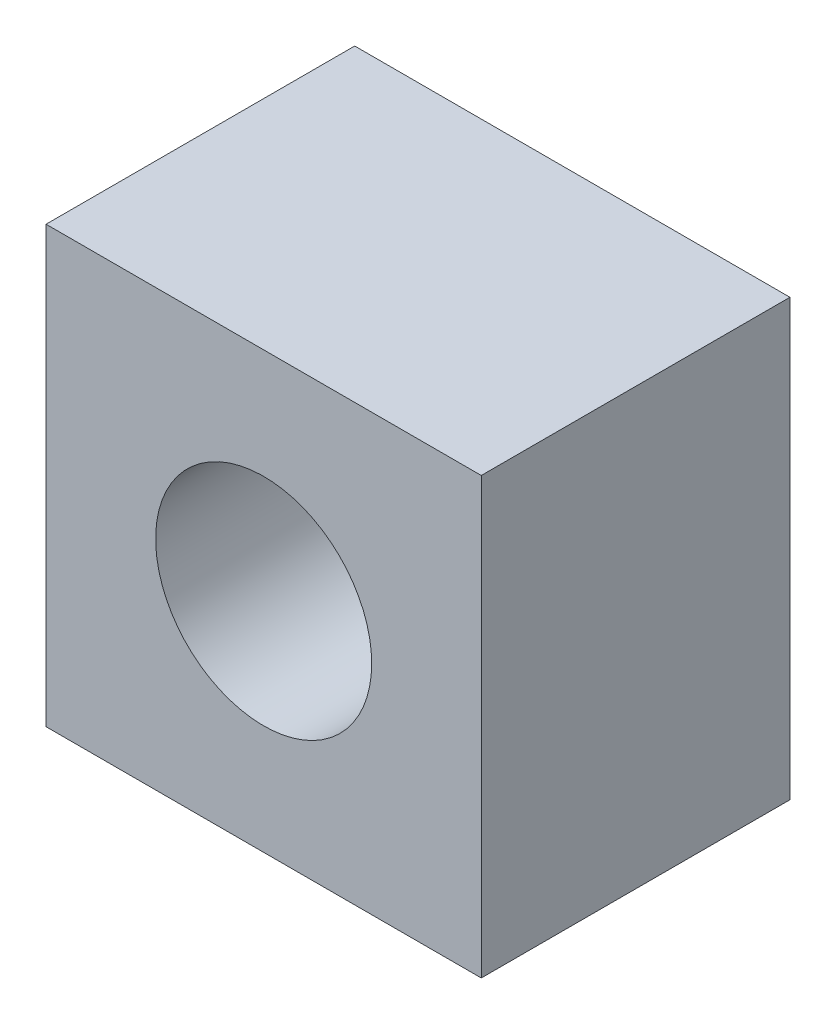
from build123d import *

# Parameters (mm, degrees)
ESQUISSE1_W      = 14.1
ESQUISSE1_H      = 14.1
ESQUISSE1_R      = 3.5
EXTRUSION1_DEPTH = 10


with BuildPart() as part:
    # Esquisse1 → Extrusion1 (new body)
    with BuildSketch(Plane.XY):
        Rectangle(ESQUISSE1_W, ESQUISSE1_H)
        Circle(ESQUISSE1_R, mode=Mode.SUBTRACT)
    extrude(amount=EXTRUSION1_DEPTH)


solid = part.part
